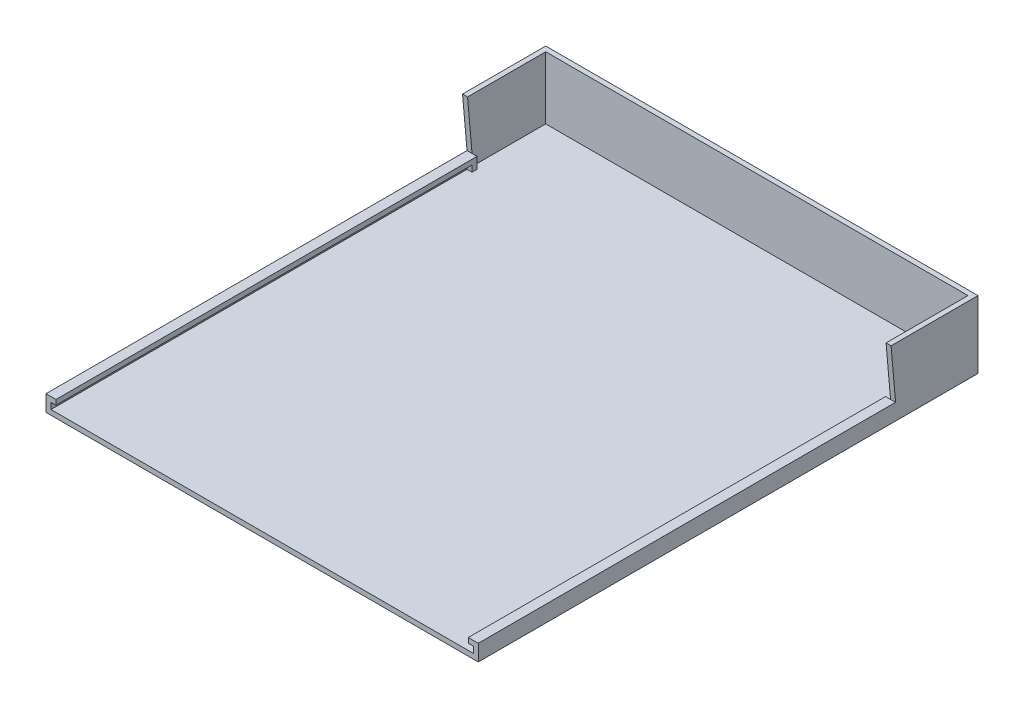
from build123d import *

# Parameters (mm, degrees)
SKETCH1_W           = 173
SKETCH1_H           = 200
BOSS_EXTRUDE1_DEPTH = 2
SKETCH2_W           = 2
SKETCH2_H           = 200
BOSS_EXTRUDE2_DEPTH = 4.5
SKETCH3_W           = 200
SKETCH3_H           = 2
BOSS_EXTRUDE3_DEPTH = 2
SKETCH4_W           = 200
SKETCH4_H           = 2
BOSS_EXTRUDE4_DEPTH = 2
SKETCH5_W           = 173
SKETCH5_H           = 33.5
CUT_EXTRUDE1_DEPTH  = 4.5
SKETCH6_W           = 4
SKETCH6_H           = 0.5
SKETCH6_H_2         = 2
BOSS_EXTRUDE5_DEPTH = 4.5
BOSS_EXTRUDE6_DEPTH = 25
BOSS_EXTRUDE7_DEPTH = 2
BOSS_EXTRUDE8_DEPTH = 2


with BuildPart() as part:
    # Sketch1 → Boss-Extrude1 (new body)
    with BuildSketch(Plane(origin=(0, 0, 0), x_dir=(1, 0, 0), z_dir=(0, 1, 0))):
        Rectangle(SKETCH1_W, SKETCH1_H)
    extrude(amount=BOSS_EXTRUDE1_DEPTH)

    # Sketch2 → Boss-Extrude2 (add)
    with BuildSketch(Plane(origin=(0, 2, 0), x_dir=(1, 0, 0), z_dir=(0, 1, 0))):
        with Locations((-85.5, 0)):
            Rectangle(SKETCH2_W, SKETCH2_H)
        with Locations((85.5, 0)):
            Rectangle(SKETCH2_W, SKETCH2_H)
    extrude(amount=BOSS_EXTRUDE2_DEPTH)

    # Sketch3 → Boss-Extrude3 (add)
    with BuildSketch(Plane(origin=(-84.5, 0, 0), x_dir=(0, 0, -1), z_dir=(1, 0, 0))):
        with Locations((0, 5.5)):
            Rectangle(SKETCH3_W, SKETCH3_H)
    extrude(amount=BOSS_EXTRUDE3_DEPTH)

    # Sketch4 → Boss-Extrude4 (add)
    with BuildSketch(Plane.ZY.offset(-84.5)):
        with Locations((0, 5.5)):
            Rectangle(SKETCH4_W, SKETCH4_H)
    extrude(amount=BOSS_EXTRUDE4_DEPTH)

    # Sketch5 → Cut-Extrude1 (cut)
    with BuildSketch(Plane(origin=(0, 6.5, 0), x_dir=(1, 0, 0), z_dir=(0, 1, 0))):
        with Locations((0, 83.25)):
            Rectangle(SKETCH5_W, SKETCH5_H)
    extrude(amount=-CUT_EXTRUDE1_DEPTH, mode=Mode.SUBTRACT)

    # Sketch6 → Boss-Extrude5 (add)
    with BuildSketch(Plane(origin=(0, 2, 0), x_dir=(1, 0, 0), z_dir=(0, 1, 0))):
        with Locations((84.5, 66.75)):
            Rectangle(SKETCH6_W, SKETCH6_H)
        with Locations((-84.5, 67.5)):
            Rectangle(SKETCH6_W, SKETCH6_H_2)
    extrude(amount=BOSS_EXTRUDE5_DEPTH)

    # Sketch7 → Boss-Extrude6 (add)
    with BuildSketch(Plane(origin=(0, 2, 0), x_dir=(1, 0, 0), z_dir=(0, 1, 0))):
        Polygon((-86.5, 98), (-86.5, 100), (86.5, 100), (86.5, 98), (86.5, 67), (84.5, 67), (84.5, 98), (-84.5, 98), (-84.5, 68.5), (-86.5, 68.5), align=None)
    extrude(amount=BOSS_EXTRUDE6_DEPTH)

    # Sketch8 → Boss-Extrude7 (add)
    with BuildSketch(Plane.ZY.offset(86.5)):
        Polygon((-68.5, 6.5), (-68.5, 27), (-66.706482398, 27), align=None)
    extrude(amount=-BOSS_EXTRUDE7_DEPTH)

    # Sketch9 → Boss-Extrude8 (add)
    with BuildSketch(Plane(origin=(86.5, 0, 0), x_dir=(0, 0, -1), z_dir=(1, 0, 0))):
        Polygon((67, 6.5), (67, 27), (65.206482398, 27), align=None)
    extrude(amount=-BOSS_EXTRUDE8_DEPTH)


solid = part.part
